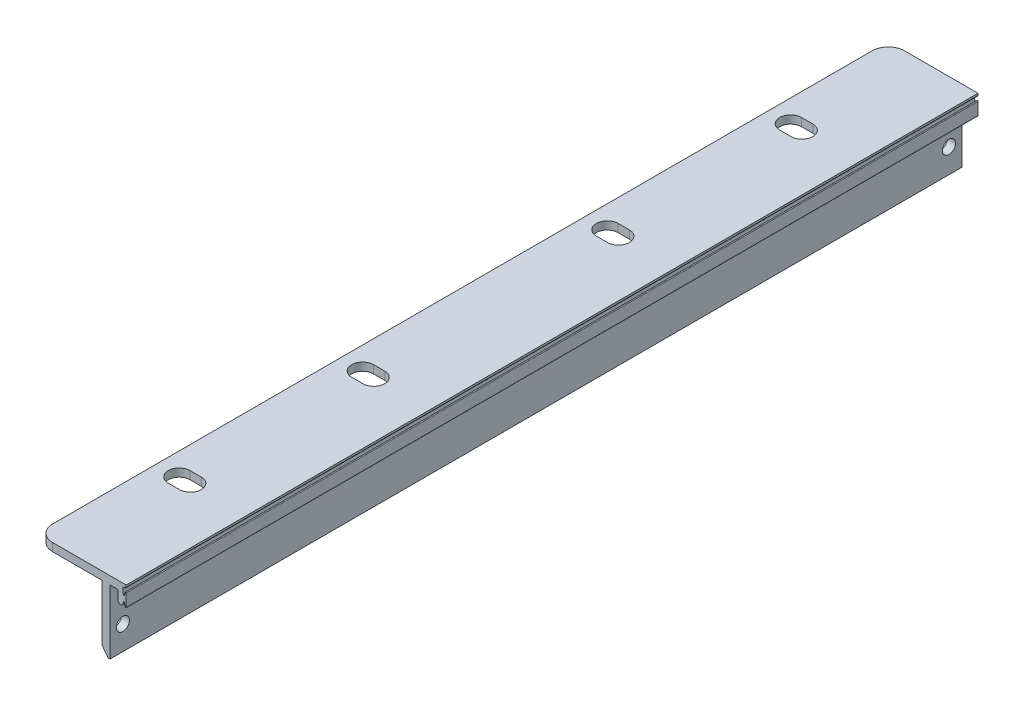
from build123d import *

# Parameters (mm, degrees)
EXTRUDE_1_DEPTH     = 132.675
CUT_EXTRUDE_1_DEPTH = 2362.761053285
SKETCH_3_R          = 2.05
CUT_EXTRUDE_2_DEPTH = 3316.32239034
FILLET_1_R          = 5
SKETCH_8_R          = 2.05
CUT_EXTRUDE_7_DEPTH = 3316.32239034
SKETCH_9_W          = 17.235434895
SKETCH_9_H          = 9.345187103
EXTRUDE_2_DEPTH     = 2.5


with BuildPart() as part:
    # Sketch 1 → Extrude 1 (new, symmetric)
    with BuildSketch(Plane.XY):
        with BuildLine():
            Line((2329.984035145, -3290.103769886), (2357.924035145, -3290.103769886))
            Line((2357.924035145, -3290.103769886), (2357.924035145, -3290.678434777))
            ThreePointArc((2357.924035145, -3290.678434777), (2357.852490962, -3290.872877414), (2357.671982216, -3290.974578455))
            Line((2357.671982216, -3290.974578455), (2357.122903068, -3291.063476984))
            ThreePointArc((2357.122903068, -3291.063476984), (2356.946343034, -3291.16063182), (2356.871091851, -3291.347580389))
            ThreePointArc((2356.871091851, -3291.347580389), (2356.901089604, -3292.278950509), (2357.065058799, -3293.196264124))
            ThreePointArc((2357.065058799, -3293.196264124), (2357.205621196, -3293.328533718), (2357.360114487, -3293.212840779))
            Line((2357.360114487, -3293.212840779), (2357.58835224, -3292.234268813))
            ThreePointArc((2357.58835224, -3292.234268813), (2357.776780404, -3292.104309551), (2357.924035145, -3292.279554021))
            Line((2357.924035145, -3292.279554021), (2357.924035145, -3296.127985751))
            ThreePointArc((2357.924035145, -3296.127985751), (2357.774272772, -3296.303549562), (2357.587277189, -3296.168330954))
            Line((2357.587277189, -3296.168330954), (2357.361062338, -3295.049054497))
            ThreePointArc((2357.361062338, -3295.049054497), (2357.210519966, -3294.92881108), (2357.065777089, -3295.055976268))
            Line((2357.065777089, -3295.055976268), (2356.933150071, -3295.682639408))
            ThreePointArc((2356.933150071, -3295.682639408), (2356.085568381, -3296.299295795), (2355.384035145, -3295.520507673))
            Line((2355.384035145, -3295.520507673), (2355.384035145, -3292.603769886))
            Line((2355.384035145, -3292.603769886), (2352.884035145, -3292.603769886))
            Line((2352.884035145, -3292.603769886), (2352.884035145, -3312.603769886))
            Line((2352.884035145, -3312.603769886), (2352.284035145, -3312.603769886))
            Line((2352.284035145, -3312.603769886), (2350.384035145, -3310.103769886))
            Line((2350.384035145, -3310.103769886), (2350.384035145, -3292.603769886))
            Line((2350.384035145, -3292.603769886), (2329.984035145, -3292.603769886))
            Line((2329.984035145, -3292.603769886), (2329.984035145, -3290.103769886))
        make_face()
    extrude(amount=EXTRUDE_1_DEPTH, both=True)

    # Sketch 2 → Cut-Extrude 1 (cut, through all)
    with BuildSketch(Plane(origin=(0, -3290.103769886, 0), x_dir=(1, 0, 0), z_dir=(0, 1, 0))):
        with BuildLine():
            Line((2340.484035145, 34.7), (2336.984035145, 34.7))
            ThreePointArc((2336.984035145, 34.7), (2333.584035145, 38.1), (2336.984035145, 41.5))
            Line((2336.984035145, 41.5), (2340.484035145, 41.5))
            ThreePointArc((2340.484035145, 41.5), (2343.884035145, 38.1), (2340.484035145, 34.7))
        make_face()
        with BuildLine():
            Line((2340.484035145, -91.85), (2336.984035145, -91.85))
            ThreePointArc((2336.984035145, -91.85), (2333.584035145, -95.25), (2336.984035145, -98.65))
            Line((2336.984035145, -98.65), (2340.484035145, -98.65))
            ThreePointArc((2340.484035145, -98.65), (2343.884035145, -95.25), (2340.484035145, -91.85))
        make_face()
        with BuildLine():
            Line((2340.484035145, 98.65), (2336.984035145, 98.65))
            ThreePointArc((2336.984035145, 98.65), (2333.584035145, 95.25), (2336.984035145, 91.85))
            Line((2336.984035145, 91.85), (2340.484035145, 91.85))
            ThreePointArc((2340.484035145, 91.85), (2343.884035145, 95.25), (2340.484035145, 98.65))
        make_face()
        with BuildLine():
            Line((2340.484035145, -41.5), (2336.984035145, -41.5))
            ThreePointArc((2336.984035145, -41.5), (2333.584035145, -38.1), (2336.984035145, -34.7))
            Line((2336.984035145, -34.7), (2340.484035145, -34.7))
            ThreePointArc((2340.484035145, -34.7), (2343.884035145, -38.1), (2340.484035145, -41.5))
        make_face()
    extrude(amount=-CUT_EXTRUDE_1_DEPTH, mode=Mode.SUBTRACT)

    # Sketch 3 → Cut-Extrude 2 (cut, through all)
    with BuildSketch(Plane.ZY.offset(-2350.384035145)):
        with Locations(Location((-128.675, -3305.103769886, 0), (0, 0, 270))):
            Circle(SKETCH_3_R)
        with Locations(Location((128.675, -3305.103769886, 0), (0, 0, 270))):
            Circle(SKETCH_3_R)
        with Locations((-128.675, -3325.103769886)):
            Circle(SKETCH_3_R)
        with Locations((128.675, -3325.103769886)):
            Circle(SKETCH_3_R)
    extrude(amount=-CUT_EXTRUDE_2_DEPTH, mode=Mode.SUBTRACT)

    # Fillet 1
    fillet_1_edges = [part.edges().sort_by_distance(p)[0] for p in [
        (2329.984035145, -3291.353769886, -132.675),
        (2329.984035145, -3291.353769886, 132.675),
    ]]
    fillet(fillet_1_edges, radius=FILLET_1_R)

    # Sketch 8 → Cut-Extrude 7 (cut, through all)
    with BuildSketch(Plane.ZY.offset(-2350.384035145)):
        with Locations(Location((-4.675, -3305.103769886, 0), (0, 0, 270))):
            Circle(SKETCH_8_R)
        with Locations(Location((4.675, -3305.103769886, 0), (0, 0, 270))):
            Circle(SKETCH_8_R)
        with Locations((4.675, -3325.103769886)):
            Circle(SKETCH_8_R)
        with Locations((-4.675, -3325.103769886)):
            Circle(SKETCH_8_R)
    extrude(amount=-CUT_EXTRUDE_7_DEPTH, mode=Mode.SUBTRACT)

    # Sketch 9 → Extrude 2 (add)
    with BuildSketch(Plane.ZY.offset(-2350.384035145)):
        with Locations((0.554057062, -3303.854524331)):
            Rectangle(SKETCH_9_W, SKETCH_9_H)
    extrude(amount=-EXTRUDE_2_DEPTH)


solid = part.part
